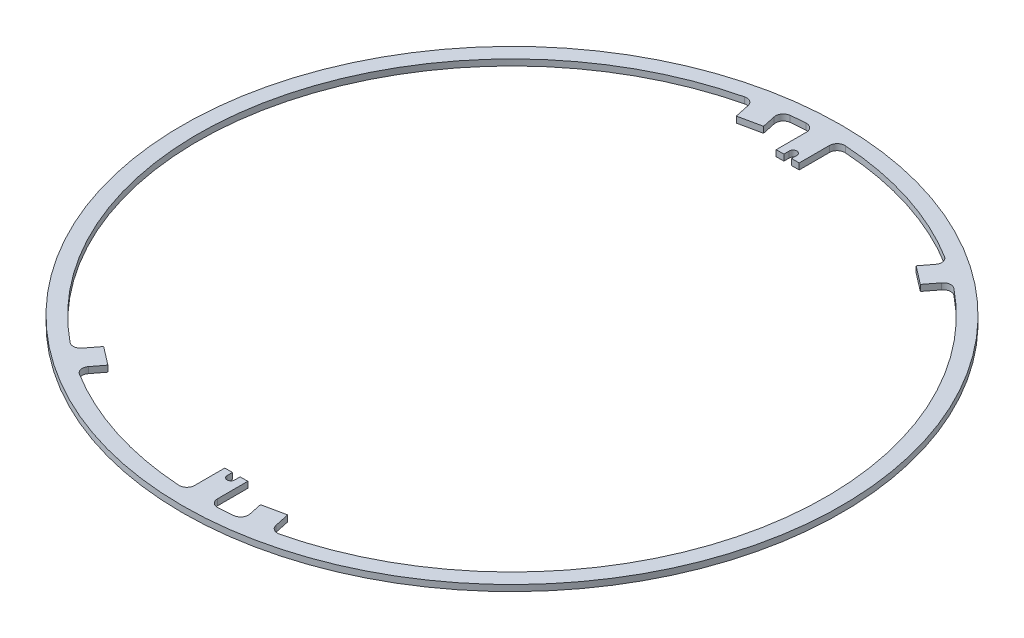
from build123d import *

# Parameters (mm, degrees)
SKETCH_1_R          = 43
SKETCH_1_R_2        = 41
EXTRUDE_1_DEPTH     = 0.8
EXTRUDE_START       = -0.8
EXTRUDE_2_DEPTH     = 0.8
FILLET_1_R          = 1
FILLET_2_R          = 1
CUT_EXTRUDE_1_DEPTH = 61.816445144
EXTRUDE_3_DEPTH     = 0.8
FILLET_3_R          = 1
EXTRUDE_4_DEPTH     = 0.8
FILLET_4_R          = 1


with BuildPart() as part:
    # Sketch 1 → Extrude 1 (new body)
    with BuildSketch(Plane(origin=(0, 0, 0), x_dir=(1, 0, 0), z_dir=(0, 1, 0))):
        with Locations(Location((0, 0, 0), (0, 0, 270))):
            Circle(SKETCH_1_R)
        with Locations(Location((0, 0, 0), (0, 0, 270))):
            Circle(SKETCH_1_R_2, mode=Mode.SUBTRACT)
    extrude(amount=EXTRUDE_1_DEPTH)

    # Sketch 2 → Extrude 2 (add)
    with BuildSketch(Plane(origin=(0, 0.8, 0), x_dir=(1, 0, 0), z_dir=(0, 1, 0)).offset(EXTRUDE_START)):
        with BuildLine():
            Line((-1.5, -35.972551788), (-1.5, -40.972551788))
            ThreePointArc((-1.5, -40.972551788), (0, -41), (1.5, -40.972551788))
            Line((1.5, -40.972551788), (1.5, -35.972551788))
            Line((1.5, -35.972551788), (-1.5, -35.972551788))
        make_face()
        with BuildLine():
            ThreePointArc((1.5, 40.972551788), (0, 41), (-1.5, 40.972551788))
            Line((-1.5, 40.972551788), (-1.5, 35.972551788))
            Line((-1.5, 35.972551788), (1.5, 35.972551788))
            Line((1.5, 35.972551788), (1.5, 40.972551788))
        make_face()
    extrude(amount=EXTRUDE_2_DEPTH)

    # Fillet 1
    fillet_1_edges = [part.edges().sort_by_distance(p)[0] for p in [
        (-1.5, 0.4, -40.972551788),
        (1.5, 0.4, -40.972551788),
    ]]
    fillet(fillet_1_edges, radius=FILLET_1_R)

    # Fillet 2
    fillet_2_edges = [part.edges().sort_by_distance(p)[0] for p in [
        (-1.5, 0.4, 40.972551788),
        (1.5, 0.4, 40.972551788),
    ]]
    fillet(fillet_2_edges, radius=FILLET_2_R)

    # Sketch 3 → Cut-Extrude 1 (cut, through all)
    with BuildSketch(Plane.XZ):
        with BuildLine():
            Line((-0.5, 36.672551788), (-0.5, 33.672551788))
            Line((-0.5, 33.672551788), (0.5, 33.672551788))
            Line((0.5, 33.672551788), (0.5, 36.672551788))
            ThreePointArc((0.5, 36.672551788), (0, 37.172551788), (-0.5, 36.672551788))
        make_face()
        with BuildLine():
            Line((0.5, -33.672551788), (0.5, -36.672551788))
            ThreePointArc((0.5, -36.672551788), (0, -37.172551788), (-0.5, -36.672551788))
            Line((-0.5, -36.672551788), (-0.5, -33.672551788))
            Line((-0.5, -33.672551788), (0.5, -33.672551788))
        make_face()
    extrude(amount=-CUT_EXTRUDE_1_DEPTH, mode=Mode.SUBTRACT)

    # Sketch 4 → Extrude 3 (add)
    with BuildSketch(Plane(origin=(0, 0.8, 0), x_dir=(1, 0, 0), z_dir=(0, 1, 0)).offset(EXTRUDE_START)):
        with BuildLine():
            Line((-24.959218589, -32.527486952), (-23.132934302, -30.147426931))
            Line((-23.132934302, -30.147426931), (-20.752874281, -31.973711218))
            Line((-20.752874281, -31.973711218), (-22.512253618, -34.26657901))
            ThreePointArc((-22.512253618, -34.26657901), (-23.751658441, -33.419436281), (-24.959218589, -32.527486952))
        make_face()
        with BuildLine():
            Line((24.959218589, 32.527486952), (23.132934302, 30.147426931))
            Line((23.132934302, 30.147426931), (20.752874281, 31.973711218))
            Line((20.752874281, 31.973711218), (22.512253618, 34.26657901))
            ThreePointArc((22.512253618, 34.26657901), (23.751658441, 33.419436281), (24.959218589, 32.527486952))
        make_face()
    extrude(amount=EXTRUDE_3_DEPTH)

    # Fillet 3
    fillet_3_edges = [part.edges().sort_by_distance(p)[0] for p in [
        (-22.512253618, 0.4, 34.26657901),
        (-24.959218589, 0.4, 32.527486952),
        (22.512253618, 0.4, -34.26657901),
        (24.959218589, 0.4, -32.527486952),
    ]]
    fillet(fillet_3_edges, radius=FILLET_3_R)

    # Sketch 6 → Extrude 4 (add)
    with BuildSketch(Plane.XZ):
        with BuildLine():
            Line((8.524379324, 40.10405163), (7.900644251, 37.169608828))
            Line((7.900644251, 37.169608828), (4.966201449, 37.7933439))
            Line((4.966201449, 37.7933439), (5.56708632, 40.620284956))
            ThreePointArc((5.56708632, 40.620284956), (7.050459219, 40.389243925), (8.524379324, 40.10405163))
        make_face()
        with BuildLine():
            Line((-4.966201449, -37.7933439), (-5.56708632, -40.620284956))
            ThreePointArc((-5.56708632, -40.620284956), (-7.050459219, -40.389243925), (-8.524379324, -40.10405163))
            Line((-8.524379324, -40.10405163), (-7.900644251, -37.169608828))
            Line((-7.900644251, -37.169608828), (-4.966201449, -37.7933439))
        make_face()
    extrude(amount=-EXTRUDE_4_DEPTH)

    # Fillet 4
    fillet_4_edges = [part.edges().sort_by_distance(p)[0] for p in [
        (8.524379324, 0.4, 40.10405163),
        (5.56708632, 0.4, 40.620284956),
        (-5.56708632, 0.4, -40.620284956),
        (-8.524379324, 0.4, -40.10405163),
    ]]
    fillet(fillet_4_edges, radius=FILLET_4_R)


solid = part.part
